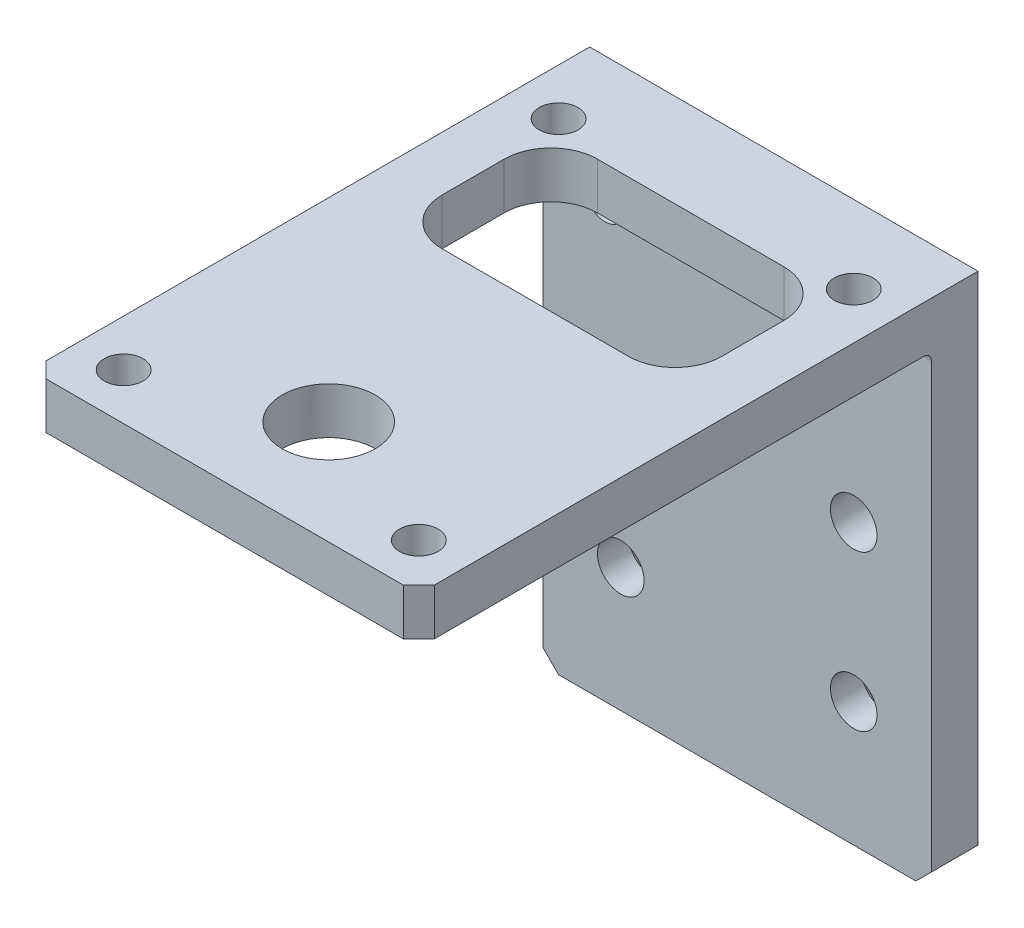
from build123d import *

# Parameters (mm, degrees)
SKETCH_1_W                = 33
SKETCH_1_H                = 36
EXTRUDE_1_DEPTH           = 25
SKETCH_2_W                = 33
SKETCH_2_H                = 30
CUT_EXTRUDE_1_DEPTH       = 46.576858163
CUT_EXTRUDE_2_DEPTH       = 43.443651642
HOLE_WIZARD_3_0_3_1_D     = 3
HOLE_WIZARD_6_0_6_1_D     = 6
HOLE_WIZARD_6_0_6_1_DEPTH = 33
HOLE_WIZARD_M3_2_D        = 2.5
CHAMFER_1_SIZE            = 1
FILLET_1_R                = 0.5
FILLET_2_R                = 3
HOLE_WIZARD_M3_1_D        = 2.5
CHAMFER_2_SIZE            = 1


with BuildPart() as part:
    # Sketch 1 → Extrude 1 (new body)
    with BuildSketch(Plane(origin=(-12.657549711, 0, 0), x_dir=(0, -1, 0), z_dir=(-1, 0, 0))):
        with Locations((13.5, 5.5)):
            Rectangle(SKETCH_1_W, SKETCH_1_H)
    extrude(amount=-EXTRUDE_1_DEPTH)

    # Sketch 2 → Cut-Extrude 1 (cut, through all)
    with BuildSketch(Plane(origin=(12.342450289, 0, 0), x_dir=(0, 0, -1), z_dir=(1, 0, 0))):
        with Locations((-7, -15)):
            Rectangle(SKETCH_2_W, SKETCH_2_H)
    extrude(amount=-CUT_EXTRUDE_1_DEPTH, mode=Mode.SUBTRACT)

    # Sketch 3 → Cut-Extrude 2 (cut, through all)
    with BuildSketch(Plane(origin=(0, 3, 0), x_dir=(-1, 0, 0), z_dir=(0, 1, 0))):
        with BuildLine():
            Line((9.157549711, -3.5), (9.157549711, 3.5))
            Line((9.157549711, 3.5), (-8.842450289, 3.5))
            Line((-8.842450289, 3.5), (-8.842450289, -3.5))
            ThreePointArc((-8.842450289, -3.5), (-7.963770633, -5.621320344), (-5.842450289, -6.5))
            Line((-5.842450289, -6.5), (6.157549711, -6.5))
            ThreePointArc((6.157549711, -6.5), (8.278870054, -5.621320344), (9.157549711, -3.5))
        make_face()
    extrude(amount=-CUT_EXTRUDE_2_DEPTH, mode=Mode.SUBTRACT)

    # Hole Wizard 3.0 _3_ _1 (through all)
    with Locations(Plane(origin=(0, 0, -12.5), x_dir=(-1, 0, 0), z_dir=(0, 0, -1))):
        with Locations((7.657549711, -22), (-7.342450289, -12), (7.657549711, -12), (-7.342450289, -22)):
            Hole(HOLE_WIZARD_3_0_3_1_D / 2)

    # Hole Wizard 6.0 _6_ _1
    with Locations(Plane(origin=(0, 3, 0), x_dir=(1, 0, 0), z_dir=(0, 1, 0))):
        with Locations((-0.157549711, -16.8)):
            Hole(HOLE_WIZARD_6_0_6_1_D / 2, depth=HOLE_WIZARD_6_0_6_1_DEPTH)

    # Hole Wizard M3 _2 (through all)
    with Locations(Plane(origin=(0, 3, 0), x_dir=(1, 0, 0), z_dir=(0, 1, 0))):
        with Locations((9.342450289, 7.5), (9.342450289, -20.5), (-9.657549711, -20.5), (-9.657549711, 7.5)):
            Hole(HOLE_WIZARD_M3_2_D / 2)

    # Chamfer 1
    chamfer_1_edges = [part.edges().sort_by_distance(p)[0] for p in [
        (12.342450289, -30, -11),
        (-12.657549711, 1.5, 23.5),
        (12.342450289, 1.5, 23.5),
        (-12.657549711, -30, -11),
    ]]
    chamfer(chamfer_1_edges, length=CHAMFER_1_SIZE)

    # Fillet 1
    fillet_1_edges = [part.edges().sort_by_distance(p)[0] for p in [
        (-0.157549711, 0, -9.5),
    ]]
    fillet(fillet_1_edges, radius=FILLET_1_R)

    # Fillet 2
    fillet_2_edges = [part.edges().sort_by_distance(p)[0] for p in [
        (8.842450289, 1.5, 3.5),
        (-9.157549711, 1.5, 3.5),
    ]]
    fillet(fillet_2_edges, radius=FILLET_2_R)

    # Hole Wizard M3 _1 (through all)
    with Locations(Plane(origin=(8.342450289, -2, -12.5), x_dir=(-1, 0, 0), z_dir=(0, 0, -1))):
        with Locations((0, 0), (17, 0)):
            Hole(HOLE_WIZARD_M3_1_D / 2)

    # Chamfer 2
    chamfer_2_edges = [part.edges().sort_by_distance(p)[0] for p in [
        (5.842450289, -22, -12.5),
        (-9.157549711, -22, -12.5),
    ]]
    chamfer(chamfer_2_edges, length=CHAMFER_2_SIZE)


solid = part.part
